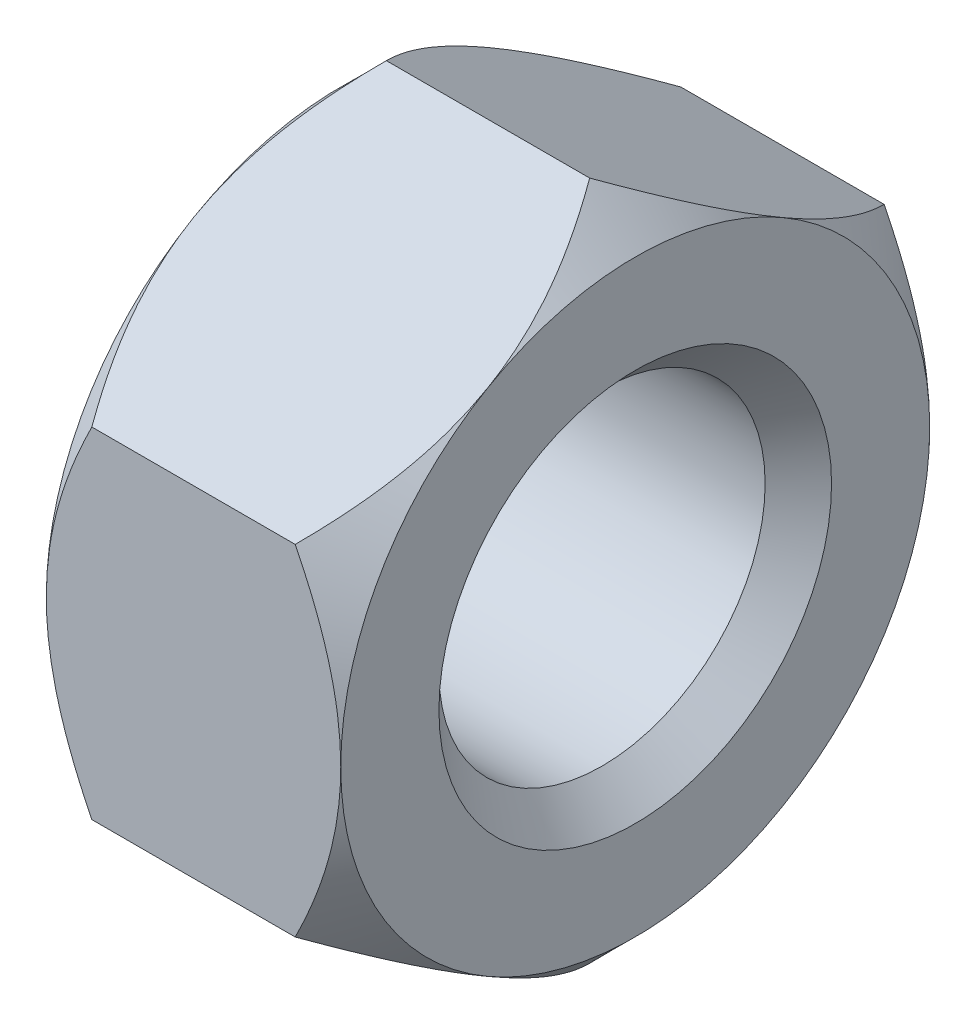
ISO-10303-21;
HEADER;
FILE_DESCRIPTION(('STEP AP214'),'2;1');
FILE_NAME('part.step','',(''),(''),'','','');
FILE_SCHEMA(('AUTOMOTIVE_DESIGN { 1 0 10303 214 1 1 1 1 }'));
ENDSEC;
DATA;
#1=APPLICATION_CONTEXT('core data for automotive mechanical design processes');
#2=APPLICATION_PROTOCOL_DEFINITION('international standard','automotive_design',2000,#1);
#3=PRODUCT_CONTEXT('',#1,'mechanical');
#4=PRODUCT('Part','Part','',(#3));
#5=PRODUCT_RELATED_PRODUCT_CATEGORY('part','',(#4));
#6=PRODUCT_DEFINITION_FORMATION('','',#4);
#7=PRODUCT_DEFINITION_CONTEXT('part definition',#1,'design');
#8=PRODUCT_DEFINITION('design','',#6,#7);
#9=PRODUCT_DEFINITION_SHAPE('','',#8);
#10=(LENGTH_UNIT() NAMED_UNIT(*) SI_UNIT(.MILLI.,.METRE.));
#11=(NAMED_UNIT(*) PLANE_ANGLE_UNIT() SI_UNIT($,.RADIAN.));
#12=(NAMED_UNIT(*) SI_UNIT($,.STERADIAN.) SOLID_ANGLE_UNIT());
#13=UNCERTAINTY_MEASURE_WITH_UNIT(LENGTH_MEASURE(1.E-05),#10,'distance_accuracy_value','');
#14=(GEOMETRIC_REPRESENTATION_CONTEXT(3) GLOBAL_UNCERTAINTY_ASSIGNED_CONTEXT((#13)) GLOBAL_UNIT_ASSIGNED_CONTEXT((#10,
#11,#12)) REPRESENTATION_CONTEXT('',''));
#15=CARTESIAN_POINT('',(0.,0.,0.));
#16=DIRECTION('',(0.,0.,1.));
#17=DIRECTION('',(1.,0.,0.));
#18=AXIS2_PLACEMENT_3D('',#15,#16,#17);
#19=CARTESIAN_POINT('',(1.2,0.,0.));
#20=DIRECTION('',(1.,0.,0.));
#21=DIRECTION('',(0.,0.,-1.));
#22=AXIS2_PLACEMENT_3D('',#19,#20,#21);
#23=CONICAL_SURFACE('',#22,7.2,0.785398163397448);
#24=CARTESIAN_POINT('',(0.928318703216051,-3.46398614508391,-6.0002));
#25=CARTESIAN_POINT('',(0.868761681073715,-3.52354912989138,-5.89703388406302));
#26=CARTESIAN_POINT('',(0.811032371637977,-3.58356994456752,-5.79307478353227));
#27=CARTESIAN_POINT('',(0.699785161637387,-3.70461705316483,-5.58341504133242));
#28=CARTESIAN_POINT('',(0.64626956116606,-3.76564387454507,-5.47771348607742));
#29=CARTESIAN_POINT('',(0.492420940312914,-3.95093502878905,-5.15677979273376));
#30=CARTESIAN_POINT('',(0.399442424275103,-4.07676794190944,-4.93883079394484));
#31=CARTESIAN_POINT('',(0.240223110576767,-4.33052007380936,-4.49931920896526));
#32=CARTESIAN_POINT('',(0.173581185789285,-4.45837443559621,-4.27786895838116));
#33=CARTESIAN_POINT('',(0.0964928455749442,-4.65225794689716,-3.94205286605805));
#34=CARTESIAN_POINT('',(0.0746194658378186,-4.71717123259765,-3.82961975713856));
#35=CARTESIAN_POINT('',(0.0389925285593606,-4.84754743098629,-3.60380155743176));
#36=CARTESIAN_POINT('',(0.0252377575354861,-4.9130102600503,-3.49041661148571));
#37=CARTESIAN_POINT('',(0.0021759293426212,-5.0725340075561,-3.21411337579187));
#38=CARTESIAN_POINT('',(-0.00266289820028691,-5.16676680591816,-3.05089738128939));
#39=CARTESIAN_POINT('',(0.0054586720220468,-5.35506256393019,-2.72475956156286));
#40=CARTESIAN_POINT('',(0.0184253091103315,-5.44912545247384,-2.56183785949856));
#41=CARTESIAN_POINT('',(0.0613934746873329,-5.63636442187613,-2.23753045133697));
#42=CARTESIAN_POINT('',(0.0914140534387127,-5.72953939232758,-2.07614666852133));
#43=CARTESIAN_POINT('',(0.166857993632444,-5.91428788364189,-1.75615289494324));
#44=CARTESIAN_POINT('',(0.212280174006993,-6.00586152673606,-1.59754269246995));
#45=CARTESIAN_POINT('',(0.305727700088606,-6.16842140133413,-1.31598073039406));
#46=CARTESIAN_POINT('',(0.351295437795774,-6.23976758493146,-1.19240551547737));
#47=CARTESIAN_POINT('',(0.449774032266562,-6.38117919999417,-0.947473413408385));
#48=CARTESIAN_POINT('',(0.502685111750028,-6.45124459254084,-0.826116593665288));
#49=CARTESIAN_POINT('',(0.614664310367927,-6.58987394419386,-0.586003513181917));
#50=CARTESIAN_POINT('',(0.673713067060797,-6.6584418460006,-0.467240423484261));
#51=CARTESIAN_POINT('',(0.797192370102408,-6.79430795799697,-0.231913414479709));
#52=CARTESIAN_POINT('',(0.861619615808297,-6.86160691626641,-0.115348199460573));
#53=CARTESIAN_POINT('',(0.92831870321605,-6.92831870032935,0.000199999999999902));
#54=B_SPLINE_CURVE_WITH_KNOTS('',3,(#24,#25,#26,#27,#28,#29,#30,#31,#32,#33,#34,#35,#36,#37,#38,
#39,#40,#41,#42,#43,#44,#45,#46,#47,#48,#49,#50,#51,#52,#53),.UNSPECIFIED.,.F.,.F.,(4,2,2,2,2,2,
2,2,2,2,2,2,2,2,4),(0.,0.399529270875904,0.799275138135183,1.6030826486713,2.39412640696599,
2.78887248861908,3.18355955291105,3.74826388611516,4.31316615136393,4.87870069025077,
5.44419187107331,5.89335590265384,6.34253356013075,6.79033489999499,7.23786342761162),.UNSPECIFIED.);
#55=CARTESIAN_POINT('',(0.,-5.19615242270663,-3.));
#56=VERTEX_POINT('',#55);
#57=CARTESIAN_POINT('',(0.928203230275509,-6.92820323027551,0.));
#58=VERTEX_POINT('',#57);
#59=EDGE_CURVE('E306',#56,#58,#54,.T.);
#60=ORIENTED_EDGE('',*,*,#59,.T.);
#61=CARTESIAN_POINT('',(0.928318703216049,-6.92831870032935,-0.000200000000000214));
#62=CARTESIAN_POINT('',(0.868761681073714,-6.86875571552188,0.102966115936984));
#63=CARTESIAN_POINT('',(0.811032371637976,-6.80873490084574,0.206925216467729));
#64=CARTESIAN_POINT('',(0.699785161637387,-6.68768779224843,0.416584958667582));
#65=CARTESIAN_POINT('',(0.64626956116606,-6.62666097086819,0.52228651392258));
#66=CARTESIAN_POINT('',(0.492420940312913,-6.44136981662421,0.843220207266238));
#67=CARTESIAN_POINT('',(0.399442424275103,-6.31553690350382,1.06116920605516));
#68=CARTESIAN_POINT('',(0.240223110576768,-6.0617847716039,1.50068079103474));
#69=CARTESIAN_POINT('',(0.173581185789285,-5.93393040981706,1.72213104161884));
#70=CARTESIAN_POINT('',(0.0964928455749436,-5.74004689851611,2.05794713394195));
#71=CARTESIAN_POINT('',(0.074619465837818,-5.67513361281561,2.17038024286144));
#72=CARTESIAN_POINT('',(0.03899252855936,-5.54475741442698,2.39619844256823));
#73=CARTESIAN_POINT('',(0.0252377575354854,-5.47929458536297,2.50958338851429));
#74=CARTESIAN_POINT('',(0.00217592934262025,-5.31977083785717,2.78588662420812));
#75=CARTESIAN_POINT('',(-0.00266289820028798,-5.22553803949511,2.9491026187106));
#76=CARTESIAN_POINT('',(0.00545867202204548,-5.03724228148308,3.27524043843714));
#77=CARTESIAN_POINT('',(0.0184253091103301,-4.94317939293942,3.43816214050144));
#78=CARTESIAN_POINT('',(0.0613934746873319,-4.75594042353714,3.76246954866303));
#79=CARTESIAN_POINT('',(0.0914140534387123,-4.66276545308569,3.92385333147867));
#80=CARTESIAN_POINT('',(0.166857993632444,-4.47801696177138,4.24384710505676));
#81=CARTESIAN_POINT('',(0.212280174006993,-4.3864433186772,4.40245730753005));
#82=CARTESIAN_POINT('',(0.305727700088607,-4.22388344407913,4.68401926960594));
#83=CARTESIAN_POINT('',(0.351295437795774,-4.15253726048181,4.80759448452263));
#84=CARTESIAN_POINT('',(0.449774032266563,-4.0111256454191,5.05252658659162));
#85=CARTESIAN_POINT('',(0.502685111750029,-3.94106025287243,5.17388340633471));
#86=CARTESIAN_POINT('',(0.614664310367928,-3.8024309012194,5.41399648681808));
#87=CARTESIAN_POINT('',(0.673713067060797,-3.73386299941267,5.53275957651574));
#88=CARTESIAN_POINT('',(0.797192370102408,-3.5979968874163,5.76808658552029));
#89=CARTESIAN_POINT('',(0.861619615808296,-3.53069792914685,5.88465180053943));
#90=CARTESIAN_POINT('',(0.92831870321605,-3.46398614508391,6.0002));
#91=B_SPLINE_CURVE_WITH_KNOTS('',3,(#61,#62,#63,#64,#65,#66,#67,#68,#69,#70,#71,#72,#73,#74,#75,
#76,#77,#78,#79,#80,#81,#82,#83,#84,#85,#86,#87,#88,#89,#90),.UNSPECIFIED.,.F.,.F.,(4,2,2,2,2,2,
2,2,2,2,2,2,2,2,4),(0.,0.399529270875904,0.799275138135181,1.6030826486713,2.39412640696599,
2.78887248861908,3.18355955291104,3.74826388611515,4.31316615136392,4.87870069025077,
5.44419187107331,5.89335590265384,6.34253356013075,6.79033489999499,7.23786342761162),.UNSPECIFIED.);
#92=CARTESIAN_POINT('',(0.,-5.19615242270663,3.));
#93=VERTEX_POINT('',#92);
#94=EDGE_CURVE('E234',#58,#93,#91,.T.);
#95=ORIENTED_EDGE('',*,*,#94,.T.);
#96=CARTESIAN_POINT('',(0.,0.,0.));
#97=DIRECTION('',(-1.,0.,0.));
#98=DIRECTION('',(0.,0.,1.));
#99=AXIS2_PLACEMENT_3D('',#96,#97,#98);
#100=CIRCLE('',#99,6.);
#101=EDGE_CURVE('E270',#56,#93,#100,.T.);
#102=ORIENTED_EDGE('',*,*,#101,.F.);
#103=EDGE_LOOP('',(#60,#95,#102));
#104=FACE_BOUND('',#103,.T.);
#105=ADVANCED_FACE('F16',(#104),#23,.T.);
#106=CARTESIAN_POINT('',(0.,0.,6.));
#107=VERTEX_POINT('',#106);
#108=EDGE_CURVE('E25',#93,#107,#100,.T.);
#109=ORIENTED_EDGE('',*,*,#108,.F.);
#110=CARTESIAN_POINT('',(0.928203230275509,-3.46410161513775,6.));
#111=VERTEX_POINT('',#110);
#112=EDGE_CURVE('E235',#93,#111,#91,.T.);
#113=ORIENTED_EDGE('',*,*,#112,.T.);
#114=CARTESIAN_POINT('',(3.47987604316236,-7.33948566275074,6.));
#115=CARTESIAN_POINT('',(3.34294599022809,-7.16258361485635,6.));
#116=CARTESIAN_POINT('',(3.2072121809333,-6.98474101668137,6.));
#117=CARTESIAN_POINT('',(2.93868717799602,-6.62678585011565,6.));
#118=CARTESIAN_POINT('',(2.80589667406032,-6.446672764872,6.));
#119=CARTESIAN_POINT('',(2.54286396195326,-6.0824730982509,6.));
#120=CARTESIAN_POINT('',(2.41264923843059,-5.89836660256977,6.));
#121=CARTESIAN_POINT('',(2.15664623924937,-5.52711162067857,6.));
#122=CARTESIAN_POINT('',(2.03085766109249,-5.33996334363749,6.));
#123=CARTESIAN_POINT('',(1.77665145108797,-4.94971277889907,6.));
#124=CARTESIAN_POINT('',(1.64860246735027,-4.7463691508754,6.));
#125=CARTESIAN_POINT('',(1.40029956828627,-4.33490017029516,6.));
#126=CARTESIAN_POINT('',(1.28004699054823,-4.12677400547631,6.));
#127=CARTESIAN_POINT('',(1.04988607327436,-3.70565740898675,6.));
#128=CARTESIAN_POINT('',(0.939947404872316,-3.49268368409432,6.));
#129=CARTESIAN_POINT('',(0.732877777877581,-3.06064741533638,6.));
#130=CARTESIAN_POINT('',(0.635740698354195,-2.84158784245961,6.));
#131=CARTESIAN_POINT('',(0.467107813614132,-2.42007531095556,6.));
#132=CARTESIAN_POINT('',(0.393993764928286,-2.2182763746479,6.));
#133=CARTESIAN_POINT('',(0.263909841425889,-1.8094430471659,6.));
#134=CARTESIAN_POINT('',(0.206940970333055,-1.6024083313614,6.));
#135=CARTESIAN_POINT('',(0.113220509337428,-1.18800324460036,6.));
#136=CARTESIAN_POINT('',(0.0760944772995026,-0.980719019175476,6.));
#137=CARTESIAN_POINT('',(0.0228506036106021,-0.563454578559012,6.));
#138=CARTESIAN_POINT('',(0.00672812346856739,-0.353474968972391,6.));
#139=CARTESIAN_POINT('',(-0.00307623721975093,0.0572444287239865,6.));
#140=CARTESIAN_POINT('',(0.00223419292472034,0.257960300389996,6.));
#141=CARTESIAN_POINT('',(0.0326631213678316,0.657874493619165,6.));
#142=CARTESIAN_POINT('',(0.0577833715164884,0.857072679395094,6.));
#143=CARTESIAN_POINT('',(0.126821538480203,1.25588993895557,6.));
#144=CARTESIAN_POINT('',(0.171075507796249,1.45544982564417,6.));
#145=CARTESIAN_POINT('',(0.275893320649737,1.85015647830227,6.));
#146=CARTESIAN_POINT('',(0.336456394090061,2.04530345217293,6.));
#147=CARTESIAN_POINT('',(0.474332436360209,2.43982581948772,6.));
#148=CARTESIAN_POINT('',(0.552297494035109,2.63897061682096,6.));
#149=CARTESIAN_POINT('',(0.720291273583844,3.03215031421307,6.));
#150=CARTESIAN_POINT('',(0.810325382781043,3.22618288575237,6.));
#151=CARTESIAN_POINT('',(1.00032353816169,3.61004589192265,6.));
#152=CARTESIAN_POINT('',(1.10031798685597,3.79986115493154,6.));
#153=CARTESIAN_POINT('',(1.30803908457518,4.17514690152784,6.));
#154=CARTESIAN_POINT('',(1.41576455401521,4.36061804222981,6.));
#155=CARTESIAN_POINT('',(1.63197601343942,4.71872935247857,6.));
#156=CARTESIAN_POINT('',(1.7401625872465,4.89155125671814,6.));
#157=CARTESIAN_POINT('',(1.96115434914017,5.23422543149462,6.));
#158=CARTESIAN_POINT('',(2.07395988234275,5.40407747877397,6.));
#159=CARTESIAN_POINT('',(2.30245181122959,5.73983837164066,6.));
#160=CARTESIAN_POINT('',(2.41810793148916,5.90576789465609,6.));
#161=CARTESIAN_POINT('',(2.65253085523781,6.23534855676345,6.));
#162=CARTESIAN_POINT('',(2.77129679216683,6.39900031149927,6.));
#163=CARTESIAN_POINT('',(2.8913360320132,6.56169615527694,6.));
#164=B_SPLINE_CURVE_WITH_KNOTS('',3,(#114,#115,#116,#117,#118,#119,#120,#121,#122,#123,#124,
#125,#126,#127,#128,#129,#130,#131,#132,#133,#134,#135,#136,#137,#138,#139,#140,#141,#142,#143,
#144,#145,#146,#147,#148,#149,#150,#151,#152,#153,#154,#155,#156,#157,#158,#159,#160,#161,#162,
#163),.UNSPECIFIED.,.F.,.F.,(4,2,2,2,2,2,2,2,2,2,2,2,2,2,2,2,2,2,2,2,2,2,2,2,4),(0.,
0.67112865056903,1.34241293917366,2.01886460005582,2.69526993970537,3.41603774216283,
4.1369288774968,4.8556289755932,5.57398417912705,6.21733955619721,6.86073492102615,
7.49151728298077,8.1221603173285,8.7235066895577,9.32490624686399,9.9373271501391,
10.5497191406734,11.190817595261,11.8322031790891,12.475610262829,13.1189193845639,
13.7305078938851,14.3421421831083,14.9488822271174,15.555454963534),.UNSPECIFIED.);
#165=EDGE_CURVE('E244',#111,#107,#164,.T.);
#166=ORIENTED_EDGE('',*,*,#165,.T.);
#167=EDGE_LOOP('',(#109,#113,#166));
#168=FACE_BOUND('',#167,.T.);
#169=ADVANCED_FACE('F296',(#168),#23,.T.);
#170=CARTESIAN_POINT('',(0.,5.19615242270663,3.));
#171=VERTEX_POINT('',#170);
#172=EDGE_CURVE('E11',#107,#171,#100,.T.);
#173=ORIENTED_EDGE('',*,*,#172,.F.);
#174=CARTESIAN_POINT('',(0.928203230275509,3.46410161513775,6.));
#175=VERTEX_POINT('',#174);
#176=EDGE_CURVE('E135',#107,#175,#164,.T.);
#177=ORIENTED_EDGE('',*,*,#176,.T.);
#178=CARTESIAN_POINT('',(0.928318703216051,3.46398614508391,6.0002));
#179=CARTESIAN_POINT('',(0.868761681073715,3.52354912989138,5.89703388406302));
#180=CARTESIAN_POINT('',(0.811032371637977,3.58356994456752,5.79307478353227));
#181=CARTESIAN_POINT('',(0.699785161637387,3.70461705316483,5.58341504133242));
#182=CARTESIAN_POINT('',(0.64626956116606,3.76564387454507,5.47771348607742));
#183=CARTESIAN_POINT('',(0.492420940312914,3.95093502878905,5.15677979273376));
#184=CARTESIAN_POINT('',(0.399442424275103,4.07676794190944,4.93883079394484));
#185=CARTESIAN_POINT('',(0.240223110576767,4.33052007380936,4.49931920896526));
#186=CARTESIAN_POINT('',(0.173581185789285,4.45837443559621,4.27786895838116));
#187=CARTESIAN_POINT('',(0.0964928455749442,4.65225794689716,3.94205286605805));
#188=CARTESIAN_POINT('',(0.0746194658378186,4.71717123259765,3.82961975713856));
#189=CARTESIAN_POINT('',(0.0389925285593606,4.84754743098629,3.60380155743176));
#190=CARTESIAN_POINT('',(0.0252377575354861,4.9130102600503,3.49041661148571));
#191=CARTESIAN_POINT('',(0.0021759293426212,5.0725340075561,3.21411337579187));
#192=CARTESIAN_POINT('',(-0.00266289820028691,5.16676680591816,3.05089738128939));
#193=CARTESIAN_POINT('',(0.0054586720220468,5.35506256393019,2.72475956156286));
#194=CARTESIAN_POINT('',(0.0184253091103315,5.44912545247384,2.56183785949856));
#195=CARTESIAN_POINT('',(0.0613934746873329,5.63636442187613,2.23753045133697));
#196=CARTESIAN_POINT('',(0.0914140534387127,5.72953939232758,2.07614666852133));
#197=CARTESIAN_POINT('',(0.166857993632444,5.91428788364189,1.75615289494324));
#198=CARTESIAN_POINT('',(0.212280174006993,6.00586152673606,1.59754269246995));
#199=CARTESIAN_POINT('',(0.305727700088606,6.16842140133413,1.31598073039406));
#200=CARTESIAN_POINT('',(0.351295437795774,6.23976758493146,1.19240551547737));
#201=CARTESIAN_POINT('',(0.449774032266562,6.38117919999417,0.947473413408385));
#202=CARTESIAN_POINT('',(0.502685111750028,6.45124459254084,0.826116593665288));
#203=CARTESIAN_POINT('',(0.614664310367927,6.58987394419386,0.586003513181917));
#204=CARTESIAN_POINT('',(0.673713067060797,6.6584418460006,0.467240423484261));
#205=CARTESIAN_POINT('',(0.797192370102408,6.79430795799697,0.231913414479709));
#206=CARTESIAN_POINT('',(0.861619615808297,6.86160691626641,0.115348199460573));
#207=CARTESIAN_POINT('',(0.92831870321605,6.92831870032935,-0.000199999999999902));
#208=B_SPLINE_CURVE_WITH_KNOTS('',3,(#178,#179,#180,#181,#182,#183,#184,#185,#186,#187,#188,
#189,#190,#191,#192,#193,#194,#195,#196,#197,#198,#199,#200,#201,#202,#203,#204,#205,#206,#207),
.UNSPECIFIED.,.F.,.F.,(4,2,2,2,2,2,2,2,2,2,2,2,2,2,4),(0.,0.399529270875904,0.799275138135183,
1.6030826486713,2.39412640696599,2.78887248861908,3.18355955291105,3.74826388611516,
4.31316615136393,4.87870069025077,5.44419187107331,5.89335590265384,6.34253356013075,
6.79033489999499,7.23786342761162),.UNSPECIFIED.);
#209=EDGE_CURVE('E136',#175,#171,#208,.T.);
#210=ORIENTED_EDGE('',*,*,#209,.T.);
#211=EDGE_LOOP('',(#173,#177,#210));
#212=FACE_BOUND('',#211,.T.);
#213=ADVANCED_FACE('F134',(#212),#23,.T.);
#214=CARTESIAN_POINT('',(3.47987604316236,-7.33948566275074,-6.));
#215=CARTESIAN_POINT('',(3.34294599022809,-7.16258361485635,-6.));
#216=CARTESIAN_POINT('',(3.2072121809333,-6.98474101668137,-6.));
#217=CARTESIAN_POINT('',(2.93868717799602,-6.62678585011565,-6.));
#218=CARTESIAN_POINT('',(2.80589667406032,-6.446672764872,-6.));
#219=CARTESIAN_POINT('',(2.54286396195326,-6.0824730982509,-6.));
#220=CARTESIAN_POINT('',(2.41264923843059,-5.89836660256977,-6.));
#221=CARTESIAN_POINT('',(2.15664623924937,-5.52711162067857,-6.));
#222=CARTESIAN_POINT('',(2.03085766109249,-5.33996334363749,-6.));
#223=CARTESIAN_POINT('',(1.77665145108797,-4.94971277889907,-6.));
#224=CARTESIAN_POINT('',(1.64860246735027,-4.7463691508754,-6.));
#225=CARTESIAN_POINT('',(1.40029956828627,-4.33490017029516,-6.));
#226=CARTESIAN_POINT('',(1.28004699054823,-4.12677400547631,-6.));
#227=CARTESIAN_POINT('',(1.04988607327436,-3.70565740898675,-6.));
#228=CARTESIAN_POINT('',(0.939947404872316,-3.49268368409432,-6.));
#229=CARTESIAN_POINT('',(0.732877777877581,-3.06064741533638,-6.));
#230=CARTESIAN_POINT('',(0.635740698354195,-2.84158784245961,-6.));
#231=CARTESIAN_POINT('',(0.467107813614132,-2.42007531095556,-6.));
#232=CARTESIAN_POINT('',(0.393993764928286,-2.2182763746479,-6.));
#233=CARTESIAN_POINT('',(0.263909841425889,-1.8094430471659,-6.));
#234=CARTESIAN_POINT('',(0.206940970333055,-1.6024083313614,-6.));
#235=CARTESIAN_POINT('',(0.113220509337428,-1.18800324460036,-6.));
#236=CARTESIAN_POINT('',(0.0760944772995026,-0.980719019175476,-6.));
#237=CARTESIAN_POINT('',(0.0228506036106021,-0.563454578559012,-6.));
#238=CARTESIAN_POINT('',(0.00672812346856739,-0.353474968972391,-6.));
#239=CARTESIAN_POINT('',(-0.00307623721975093,0.0572444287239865,-6.));
#240=CARTESIAN_POINT('',(0.00223419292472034,0.257960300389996,-6.));
#241=CARTESIAN_POINT('',(0.0326631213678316,0.657874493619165,-6.));
#242=CARTESIAN_POINT('',(0.0577833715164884,0.857072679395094,-6.));
#243=CARTESIAN_POINT('',(0.126821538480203,1.25588993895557,-6.));
#244=CARTESIAN_POINT('',(0.171075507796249,1.45544982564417,-6.));
#245=CARTESIAN_POINT('',(0.275893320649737,1.85015647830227,-6.));
#246=CARTESIAN_POINT('',(0.336456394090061,2.04530345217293,-6.));
#247=CARTESIAN_POINT('',(0.474332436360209,2.43982581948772,-6.));
#248=CARTESIAN_POINT('',(0.552297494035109,2.63897061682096,-6.));
#249=CARTESIAN_POINT('',(0.720291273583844,3.03215031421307,-6.));
#250=CARTESIAN_POINT('',(0.810325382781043,3.22618288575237,-6.));
#251=CARTESIAN_POINT('',(1.00032353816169,3.61004589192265,-6.));
#252=CARTESIAN_POINT('',(1.10031798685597,3.79986115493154,-6.));
#253=CARTESIAN_POINT('',(1.30803908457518,4.17514690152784,-6.));
#254=CARTESIAN_POINT('',(1.41576455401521,4.36061804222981,-6.));
#255=CARTESIAN_POINT('',(1.63197601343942,4.71872935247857,-6.));
#256=CARTESIAN_POINT('',(1.7401625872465,4.89155125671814,-6.));
#257=CARTESIAN_POINT('',(1.96115434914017,5.23422543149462,-6.));
#258=CARTESIAN_POINT('',(2.07395988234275,5.40407747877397,-6.));
#259=CARTESIAN_POINT('',(2.30245181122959,5.73983837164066,-6.));
#260=CARTESIAN_POINT('',(2.41810793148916,5.90576789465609,-6.));
#261=CARTESIAN_POINT('',(2.65253085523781,6.23534855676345,-6.));
#262=CARTESIAN_POINT('',(2.77129679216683,6.39900031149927,-6.));
#263=CARTESIAN_POINT('',(2.8913360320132,6.56169615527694,-6.));
#264=B_SPLINE_CURVE_WITH_KNOTS('',3,(#214,#215,#216,#217,#218,#219,#220,#221,#222,#223,#224,
#225,#226,#227,#228,#229,#230,#231,#232,#233,#234,#235,#236,#237,#238,#239,#240,#241,#242,#243,
#244,#245,#246,#247,#248,#249,#250,#251,#252,#253,#254,#255,#256,#257,#258,#259,#260,#261,#262,
#263),.UNSPECIFIED.,.F.,.F.,(4,2,2,2,2,2,2,2,2,2,2,2,2,2,2,2,2,2,2,2,2,2,2,2,4),(0.,
0.67112865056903,1.34241293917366,2.01886460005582,2.69526993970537,3.41603774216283,
4.1369288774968,4.8556289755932,5.57398417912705,6.21733955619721,6.86073492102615,
7.49151728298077,8.1221603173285,8.7235066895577,9.32490624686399,9.9373271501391,
10.5497191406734,11.190817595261,11.8322031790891,12.475610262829,13.1189193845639,
13.7305078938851,14.3421421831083,14.9488822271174,15.555454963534),.UNSPECIFIED.);
#265=CARTESIAN_POINT('',(0.,0.,-6.));
#266=VERTEX_POINT('',#265);
#267=CARTESIAN_POINT('',(0.928203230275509,-3.46410161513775,-6.));
#268=VERTEX_POINT('',#267);
#269=EDGE_CURVE('E362',#266,#268,#264,.F.);
#270=ORIENTED_EDGE('',*,*,#269,.T.);
#271=EDGE_CURVE('E310',#268,#56,#54,.T.);
#272=ORIENTED_EDGE('',*,*,#271,.T.);
#273=EDGE_CURVE('E126',#266,#56,#100,.T.);
#274=ORIENTED_EDGE('',*,*,#273,.F.);
#275=EDGE_LOOP('',(#270,#272,#274));
#276=FACE_BOUND('',#275,.T.);
#277=ADVANCED_FACE('F369',(#276),#23,.T.);
#278=CARTESIAN_POINT('',(0.,5.19615242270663,-3.));
#279=VERTEX_POINT('',#278);
#280=EDGE_CURVE('E24',#171,#279,#100,.T.);
#281=ORIENTED_EDGE('',*,*,#280,.F.);
#282=CARTESIAN_POINT('',(0.928203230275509,6.92820323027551,0.));
#283=VERTEX_POINT('',#282);
#284=EDGE_CURVE('E117',#171,#283,#208,.T.);
#285=ORIENTED_EDGE('',*,*,#284,.T.);
#286=CARTESIAN_POINT('',(0.928318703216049,6.92831870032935,0.000200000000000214));
#287=CARTESIAN_POINT('',(0.868761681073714,6.86875571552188,-0.102966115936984));
#288=CARTESIAN_POINT('',(0.811032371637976,6.80873490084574,-0.206925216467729));
#289=CARTESIAN_POINT('',(0.699785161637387,6.68768779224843,-0.416584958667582));
#290=CARTESIAN_POINT('',(0.64626956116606,6.62666097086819,-0.52228651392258));
#291=CARTESIAN_POINT('',(0.492420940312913,6.44136981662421,-0.843220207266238));
#292=CARTESIAN_POINT('',(0.399442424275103,6.31553690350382,-1.06116920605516));
#293=CARTESIAN_POINT('',(0.240223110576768,6.0617847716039,-1.50068079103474));
#294=CARTESIAN_POINT('',(0.173581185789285,5.93393040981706,-1.72213104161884));
#295=CARTESIAN_POINT('',(0.0964928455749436,5.74004689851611,-2.05794713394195));
#296=CARTESIAN_POINT('',(0.074619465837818,5.67513361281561,-2.17038024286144));
#297=CARTESIAN_POINT('',(0.03899252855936,5.54475741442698,-2.39619844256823));
#298=CARTESIAN_POINT('',(0.0252377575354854,5.47929458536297,-2.50958338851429));
#299=CARTESIAN_POINT('',(0.00217592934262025,5.31977083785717,-2.78588662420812));
#300=CARTESIAN_POINT('',(-0.00266289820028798,5.22553803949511,-2.9491026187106));
#301=CARTESIAN_POINT('',(0.00545867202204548,5.03724228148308,-3.27524043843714));
#302=CARTESIAN_POINT('',(0.0184253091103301,4.94317939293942,-3.43816214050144));
#303=CARTESIAN_POINT('',(0.0613934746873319,4.75594042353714,-3.76246954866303));
#304=CARTESIAN_POINT('',(0.0914140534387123,4.66276545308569,-3.92385333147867));
#305=CARTESIAN_POINT('',(0.166857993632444,4.47801696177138,-4.24384710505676));
#306=CARTESIAN_POINT('',(0.212280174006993,4.3864433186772,-4.40245730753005));
#307=CARTESIAN_POINT('',(0.305727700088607,4.22388344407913,-4.68401926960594));
#308=CARTESIAN_POINT('',(0.351295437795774,4.15253726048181,-4.80759448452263));
#309=CARTESIAN_POINT('',(0.449774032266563,4.0111256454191,-5.05252658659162));
#310=CARTESIAN_POINT('',(0.502685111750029,3.94106025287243,-5.17388340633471));
#311=CARTESIAN_POINT('',(0.614664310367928,3.8024309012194,-5.41399648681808));
#312=CARTESIAN_POINT('',(0.673713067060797,3.73386299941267,-5.53275957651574));
#313=CARTESIAN_POINT('',(0.797192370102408,3.5979968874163,-5.76808658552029));
#314=CARTESIAN_POINT('',(0.861619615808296,3.53069792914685,-5.88465180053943));
#315=CARTESIAN_POINT('',(0.92831870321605,3.46398614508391,-6.0002));
#316=B_SPLINE_CURVE_WITH_KNOTS('',3,(#286,#287,#288,#289,#290,#291,#292,#293,#294,#295,#296,
#297,#298,#299,#300,#301,#302,#303,#304,#305,#306,#307,#308,#309,#310,#311,#312,#313,#314,#315),
.UNSPECIFIED.,.F.,.F.,(4,2,2,2,2,2,2,2,2,2,2,2,2,2,4),(0.,0.399529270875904,0.799275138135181,
1.6030826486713,2.39412640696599,2.78887248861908,3.18355955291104,3.74826388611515,
4.31316615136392,4.87870069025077,5.44419187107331,5.89335590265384,6.34253356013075,
6.79033489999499,7.23786342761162),.UNSPECIFIED.);
#317=EDGE_CURVE('E106',#283,#279,#316,.T.);
#318=ORIENTED_EDGE('',*,*,#317,.T.);
#319=EDGE_LOOP('',(#281,#285,#318));
#320=FACE_BOUND('',#319,.T.);
#321=ADVANCED_FACE('F115',(#320),#23,.T.);
#322=CARTESIAN_POINT('',(6.,0.,0.));
#323=DIRECTION('',(-1.,0.,0.));
#324=DIRECTION('',(0.,0.,1.));
#325=AXIS2_PLACEMENT_3D('',#322,#323,#324);
#326=CONICAL_SURFACE('',#325,6.,0.785398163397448);
#327=CARTESIAN_POINT('',(5.07168129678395,3.46398614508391,-6.0002));
#328=CARTESIAN_POINT('',(5.13123831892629,3.52354912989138,-5.89703388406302));
#329=CARTESIAN_POINT('',(5.18896762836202,3.58356994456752,-5.79307478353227));
#330=CARTESIAN_POINT('',(5.30021483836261,3.70461705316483,-5.58341504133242));
#331=CARTESIAN_POINT('',(5.35373043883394,3.76564387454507,-5.47771348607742));
#332=CARTESIAN_POINT('',(5.50757905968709,3.95093502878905,-5.15677979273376));
#333=CARTESIAN_POINT('',(5.6005575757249,4.07676794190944,-4.93883079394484));
#334=CARTESIAN_POINT('',(5.75977688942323,4.33052007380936,-4.49931920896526));
#335=CARTESIAN_POINT('',(5.82641881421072,4.4583744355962,-4.27786895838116));
#336=CARTESIAN_POINT('',(5.90350715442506,4.65225794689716,-3.94205286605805));
#337=CARTESIAN_POINT('',(5.92538053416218,4.71717123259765,-3.82961975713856));
#338=CARTESIAN_POINT('',(5.96100747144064,4.84754743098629,-3.60380155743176));
#339=CARTESIAN_POINT('',(5.97476224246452,4.9130102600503,-3.49041661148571));
#340=CARTESIAN_POINT('',(5.99782407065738,5.0725340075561,-3.21411337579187));
#341=CARTESIAN_POINT('',(6.00266289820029,5.16676680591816,-3.05089738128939));
#342=CARTESIAN_POINT('',(5.99454132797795,5.35506256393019,-2.72475956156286));
#343=CARTESIAN_POINT('',(5.98157469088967,5.44912545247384,-2.56183785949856));
#344=CARTESIAN_POINT('',(5.93860652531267,5.63636442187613,-2.23753045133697));
#345=CARTESIAN_POINT('',(5.90858594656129,5.72953939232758,-2.07614666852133));
#346=CARTESIAN_POINT('',(5.83314200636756,5.91428788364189,-1.75615289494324));
#347=CARTESIAN_POINT('',(5.78771982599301,6.00586152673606,-1.59754269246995));
#348=CARTESIAN_POINT('',(5.6942722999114,6.16842140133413,-1.31598073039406));
#349=CARTESIAN_POINT('',(5.64870456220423,6.23976758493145,-1.19240551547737));
#350=CARTESIAN_POINT('',(5.55022596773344,6.38117919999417,-0.947473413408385));
#351=CARTESIAN_POINT('',(5.49731488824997,6.45124459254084,-0.826116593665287));
#352=CARTESIAN_POINT('',(5.38533568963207,6.58987394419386,-0.586003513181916));
#353=CARTESIAN_POINT('',(5.3262869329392,6.6584418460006,-0.467240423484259));
#354=CARTESIAN_POINT('',(5.20280762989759,6.79430795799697,-0.231913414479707));
#355=CARTESIAN_POINT('',(5.1383803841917,6.86160691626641,-0.115348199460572));
#356=CARTESIAN_POINT('',(5.07168129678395,6.92831870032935,0.000199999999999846));
#357=B_SPLINE_CURVE_WITH_KNOTS('',3,(#327,#328,#329,#330,#331,#332,#333,#334,#335,#336,#337,
#338,#339,#340,#341,#342,#343,#344,#345,#346,#347,#348,#349,#350,#351,#352,#353,#354,#355,#356),
.UNSPECIFIED.,.F.,.F.,(4,2,2,2,2,2,2,2,2,2,2,2,2,2,4),(0.,0.399529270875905,0.799275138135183,
1.6030826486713,2.39412640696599,2.78887248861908,3.18355955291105,3.74826388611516,
4.31316615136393,4.87870069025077,5.44419187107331,5.89335590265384,6.34253356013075,
6.79033489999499,7.23786342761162),.UNSPECIFIED.);
#358=CARTESIAN_POINT('',(6.,5.19615242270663,-3.));
#359=VERTEX_POINT('',#358);
#360=CARTESIAN_POINT('',(5.07179676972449,6.92820323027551,0.));
#361=VERTEX_POINT('',#360);
#362=EDGE_CURVE('E194',#359,#361,#357,.T.);
#363=ORIENTED_EDGE('',*,*,#362,.T.);
#364=CARTESIAN_POINT('',(5.07168129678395,6.92831870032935,-0.000200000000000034));
#365=CARTESIAN_POINT('',(5.13123831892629,6.86875571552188,0.102966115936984));
#366=CARTESIAN_POINT('',(5.18896762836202,6.80873490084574,0.20692521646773));
#367=CARTESIAN_POINT('',(5.30021483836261,6.68768779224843,0.416584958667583));
#368=CARTESIAN_POINT('',(5.35373043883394,6.6266609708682,0.522286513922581));
#369=CARTESIAN_POINT('',(5.50757905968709,6.44136981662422,0.843220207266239));
#370=CARTESIAN_POINT('',(5.6005575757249,6.31553690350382,1.06116920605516));
#371=CARTESIAN_POINT('',(5.75977688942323,6.0617847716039,1.50068079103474));
#372=CARTESIAN_POINT('',(5.82641881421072,5.93393040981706,1.72213104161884));
#373=CARTESIAN_POINT('',(5.90350715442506,5.74004689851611,2.05794713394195));
#374=CARTESIAN_POINT('',(5.92538053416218,5.67513361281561,2.17038024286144));
#375=CARTESIAN_POINT('',(5.96100747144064,5.54475741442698,2.39619844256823));
#376=CARTESIAN_POINT('',(5.97476224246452,5.47929458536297,2.50958338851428));
#377=CARTESIAN_POINT('',(5.99782407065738,5.31977083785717,2.78588662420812));
#378=CARTESIAN_POINT('',(6.00266289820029,5.22553803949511,2.9491026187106));
#379=CARTESIAN_POINT('',(5.99454132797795,5.03724228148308,3.27524043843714));
#380=CARTESIAN_POINT('',(5.98157469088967,4.94317939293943,3.43816214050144));
#381=CARTESIAN_POINT('',(5.93860652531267,4.75594042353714,3.76246954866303));
#382=CARTESIAN_POINT('',(5.90858594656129,4.66276545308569,3.92385333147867));
#383=CARTESIAN_POINT('',(5.83314200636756,4.47801696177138,4.24384710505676));
#384=CARTESIAN_POINT('',(5.78771982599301,4.3864433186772,4.40245730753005));
#385=CARTESIAN_POINT('',(5.6942722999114,4.22388344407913,4.68401926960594));
#386=CARTESIAN_POINT('',(5.64870456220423,4.15253726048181,4.80759448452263));
#387=CARTESIAN_POINT('',(5.55022596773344,4.0111256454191,5.05252658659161));
#388=CARTESIAN_POINT('',(5.49731488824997,3.94106025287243,5.17388340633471));
#389=CARTESIAN_POINT('',(5.38533568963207,3.8024309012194,5.41399648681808));
#390=CARTESIAN_POINT('',(5.3262869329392,3.73386299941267,5.53275957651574));
#391=CARTESIAN_POINT('',(5.20280762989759,3.5979968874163,5.76808658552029));
#392=CARTESIAN_POINT('',(5.1383803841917,3.53069792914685,5.88465180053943));
#393=CARTESIAN_POINT('',(5.07168129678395,3.46398614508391,6.0002));
#394=B_SPLINE_CURVE_WITH_KNOTS('',3,(#364,#365,#366,#367,#368,#369,#370,#371,#372,#373,#374,
#375,#376,#377,#378,#379,#380,#381,#382,#383,#384,#385,#386,#387,#388,#389,#390,#391,#392,#393),
.UNSPECIFIED.,.F.,.F.,(4,2,2,2,2,2,2,2,2,2,2,2,2,2,4),(0.,0.399529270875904,0.799275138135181,
1.6030826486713,2.39412640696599,2.78887248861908,3.18355955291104,3.74826388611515,
4.31316615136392,4.87870069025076,5.4441918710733,5.89335590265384,6.34253356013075,
6.79033489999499,7.23786342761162),.UNSPECIFIED.);
#395=CARTESIAN_POINT('',(6.,5.19615242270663,3.));
#396=VERTEX_POINT('',#395);
#397=EDGE_CURVE('E145',#361,#396,#394,.T.);
#398=ORIENTED_EDGE('',*,*,#397,.T.);
#399=CARTESIAN_POINT('',(6.,0.,0.));
#400=DIRECTION('',(-1.,0.,0.));
#401=DIRECTION('',(0.,0.,1.));
#402=AXIS2_PLACEMENT_3D('',#399,#400,#401);
#403=CIRCLE('',#402,6.);
#404=EDGE_CURVE('E269',#396,#359,#403,.T.);
#405=ORIENTED_EDGE('',*,*,#404,.T.);
#406=EDGE_LOOP('',(#363,#398,#405));
#407=FACE_BOUND('',#406,.T.);
#408=ADVANCED_FACE('F189',(#407),#326,.T.);
#409=CARTESIAN_POINT('',(6.,0.,6.));
#410=VERTEX_POINT('',#409);
#411=EDGE_CURVE('E253',#410,#396,#403,.T.);
#412=ORIENTED_EDGE('',*,*,#411,.T.);
#413=CARTESIAN_POINT('',(5.07179676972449,3.46410161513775,6.));
#414=VERTEX_POINT('',#413);
#415=EDGE_CURVE('E152',#396,#414,#394,.T.);
#416=ORIENTED_EDGE('',*,*,#415,.T.);
#417=CARTESIAN_POINT('',(2.52012395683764,-7.33948566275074,6.));
#418=CARTESIAN_POINT('',(2.65705400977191,-7.16258361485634,6.));
#419=CARTESIAN_POINT('',(2.79278781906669,-6.98474101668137,6.));
#420=CARTESIAN_POINT('',(3.06131282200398,-6.62678585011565,6.));
#421=CARTESIAN_POINT('',(3.19410332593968,-6.446672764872,6.));
#422=CARTESIAN_POINT('',(3.45713603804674,-6.0824730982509,6.));
#423=CARTESIAN_POINT('',(3.58735076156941,-5.89836660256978,6.));
#424=CARTESIAN_POINT('',(3.84335376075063,-5.52711162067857,6.));
#425=CARTESIAN_POINT('',(3.96914233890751,-5.33996334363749,6.));
#426=CARTESIAN_POINT('',(4.22334854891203,-4.94971277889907,6.));
#427=CARTESIAN_POINT('',(4.35139753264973,-4.7463691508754,6.));
#428=CARTESIAN_POINT('',(4.59970043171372,-4.33490017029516,6.));
#429=CARTESIAN_POINT('',(4.71995300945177,-4.12677400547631,6.));
#430=CARTESIAN_POINT('',(4.95011392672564,-3.70565740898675,6.));
#431=CARTESIAN_POINT('',(5.06005259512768,-3.49268368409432,6.));
#432=CARTESIAN_POINT('',(5.26712222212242,-3.06064741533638,6.));
#433=CARTESIAN_POINT('',(5.3642593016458,-2.84158784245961,6.));
#434=CARTESIAN_POINT('',(5.53289218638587,-2.42007531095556,6.));
#435=CARTESIAN_POINT('',(5.60600623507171,-2.2182763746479,6.));
#436=CARTESIAN_POINT('',(5.73609015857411,-1.8094430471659,6.));
#437=CARTESIAN_POINT('',(5.79305902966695,-1.6024083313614,6.));
#438=CARTESIAN_POINT('',(5.88677949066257,-1.18800324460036,6.));
#439=CARTESIAN_POINT('',(5.9239055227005,-0.980719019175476,6.));
#440=CARTESIAN_POINT('',(5.9771493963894,-0.563454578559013,6.));
#441=CARTESIAN_POINT('',(5.99327187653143,-0.353474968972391,6.));
#442=CARTESIAN_POINT('',(6.00307623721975,0.0572444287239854,6.));
#443=CARTESIAN_POINT('',(5.99776580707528,0.257960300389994,6.));
#444=CARTESIAN_POINT('',(5.96733687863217,0.657874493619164,6.));
#445=CARTESIAN_POINT('',(5.94221662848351,0.857072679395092,6.));
#446=CARTESIAN_POINT('',(5.8731784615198,1.25588993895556,6.));
#447=CARTESIAN_POINT('',(5.82892449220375,1.45544982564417,6.));
#448=CARTESIAN_POINT('',(5.72410667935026,1.85015647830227,6.));
#449=CARTESIAN_POINT('',(5.66354360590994,2.04530345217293,6.));
#450=CARTESIAN_POINT('',(5.52566756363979,2.43982581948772,6.));
#451=CARTESIAN_POINT('',(5.44770250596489,2.63897061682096,6.));
#452=CARTESIAN_POINT('',(5.27970872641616,3.03215031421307,6.));
#453=CARTESIAN_POINT('',(5.18967461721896,3.22618288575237,6.));
#454=CARTESIAN_POINT('',(4.99967646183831,3.61004589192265,6.));
#455=CARTESIAN_POINT('',(4.89968201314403,3.79986115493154,6.));
#456=CARTESIAN_POINT('',(4.69196091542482,4.17514690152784,6.));
#457=CARTESIAN_POINT('',(4.58423544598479,4.36061804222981,6.));
#458=CARTESIAN_POINT('',(4.36802398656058,4.71872935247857,6.));
#459=CARTESIAN_POINT('',(4.2598374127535,4.89155125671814,6.));
#460=CARTESIAN_POINT('',(4.03884565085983,5.23422543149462,6.));
#461=CARTESIAN_POINT('',(3.92604011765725,5.40407747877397,6.));
#462=CARTESIAN_POINT('',(3.69754818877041,5.73983837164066,6.));
#463=CARTESIAN_POINT('',(3.58189206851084,5.90576789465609,6.));
#464=CARTESIAN_POINT('',(3.34746914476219,6.23534855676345,6.));
#465=CARTESIAN_POINT('',(3.22870320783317,6.39900031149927,6.));
#466=CARTESIAN_POINT('',(3.1086639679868,6.56169615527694,6.));
#467=B_SPLINE_CURVE_WITH_KNOTS('',3,(#417,#418,#419,#420,#421,#422,#423,#424,#425,#426,#427,
#428,#429,#430,#431,#432,#433,#434,#435,#436,#437,#438,#439,#440,#441,#442,#443,#444,#445,#446,
#447,#448,#449,#450,#451,#452,#453,#454,#455,#456,#457,#458,#459,#460,#461,#462,#463,#464,#465,
#466),.UNSPECIFIED.,.F.,.F.,(4,2,2,2,2,2,2,2,2,2,2,2,2,2,2,2,2,2,2,2,2,2,2,2,4),(0.,
0.671128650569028,1.34241293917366,2.01886460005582,2.69526993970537,3.41603774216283,
4.13692887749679,4.8556289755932,5.57398417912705,6.21733955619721,6.86073492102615,
7.49151728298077,8.1221603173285,8.7235066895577,9.32490624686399,9.9373271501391,
10.5497191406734,11.190817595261,11.8322031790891,12.475610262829,13.1189193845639,
13.7305078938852,14.3421421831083,14.9488822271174,15.555454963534),.UNSPECIFIED.);
#468=EDGE_CURVE('E233',#414,#410,#467,.F.);
#469=ORIENTED_EDGE('',*,*,#468,.T.);
#470=EDGE_LOOP('',(#412,#416,#469));
#471=FACE_BOUND('',#470,.T.);
#472=ADVANCED_FACE('F251',(#471),#326,.T.);
#473=CARTESIAN_POINT('',(6.,-5.19615242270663,3.));
#474=VERTEX_POINT('',#473);
#475=EDGE_CURVE('E258',#474,#410,#403,.T.);
#476=ORIENTED_EDGE('',*,*,#475,.T.);
#477=CARTESIAN_POINT('',(5.07179676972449,-3.46410161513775,6.));
#478=VERTEX_POINT('',#477);
#479=EDGE_CURVE('E227',#410,#478,#467,.F.);
#480=ORIENTED_EDGE('',*,*,#479,.T.);
#481=CARTESIAN_POINT('',(5.07168129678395,-3.46398614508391,6.0002));
#482=CARTESIAN_POINT('',(5.13123831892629,-3.52354912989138,5.89703388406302));
#483=CARTESIAN_POINT('',(5.18896762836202,-3.58356994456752,5.79307478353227));
#484=CARTESIAN_POINT('',(5.30021483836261,-3.70461705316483,5.58341504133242));
#485=CARTESIAN_POINT('',(5.35373043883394,-3.76564387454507,5.47771348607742));
#486=CARTESIAN_POINT('',(5.50757905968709,-3.95093502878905,5.15677979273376));
#487=CARTESIAN_POINT('',(5.6005575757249,-4.07676794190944,4.93883079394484));
#488=CARTESIAN_POINT('',(5.75977688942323,-4.33052007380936,4.49931920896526));
#489=CARTESIAN_POINT('',(5.82641881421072,-4.4583744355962,4.27786895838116));
#490=CARTESIAN_POINT('',(5.90350715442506,-4.65225794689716,3.94205286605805));
#491=CARTESIAN_POINT('',(5.92538053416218,-4.71717123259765,3.82961975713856));
#492=CARTESIAN_POINT('',(5.96100747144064,-4.84754743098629,3.60380155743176));
#493=CARTESIAN_POINT('',(5.97476224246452,-4.9130102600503,3.49041661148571));
#494=CARTESIAN_POINT('',(5.99782407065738,-5.0725340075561,3.21411337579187));
#495=CARTESIAN_POINT('',(6.00266289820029,-5.16676680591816,3.05089738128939));
#496=CARTESIAN_POINT('',(5.99454132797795,-5.35506256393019,2.72475956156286));
#497=CARTESIAN_POINT('',(5.98157469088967,-5.44912545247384,2.56183785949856));
#498=CARTESIAN_POINT('',(5.93860652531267,-5.63636442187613,2.23753045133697));
#499=CARTESIAN_POINT('',(5.90858594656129,-5.72953939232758,2.07614666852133));
#500=CARTESIAN_POINT('',(5.83314200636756,-5.91428788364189,1.75615289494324));
#501=CARTESIAN_POINT('',(5.78771982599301,-6.00586152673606,1.59754269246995));
#502=CARTESIAN_POINT('',(5.6942722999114,-6.16842140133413,1.31598073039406));
#503=CARTESIAN_POINT('',(5.64870456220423,-6.23976758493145,1.19240551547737));
#504=CARTESIAN_POINT('',(5.55022596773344,-6.38117919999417,0.947473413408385));
#505=CARTESIAN_POINT('',(5.49731488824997,-6.45124459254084,0.826116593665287));
#506=CARTESIAN_POINT('',(5.38533568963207,-6.58987394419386,0.586003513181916));
#507=CARTESIAN_POINT('',(5.3262869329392,-6.6584418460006,0.467240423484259));
#508=CARTESIAN_POINT('',(5.20280762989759,-6.79430795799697,0.231913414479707));
#509=CARTESIAN_POINT('',(5.1383803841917,-6.86160691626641,0.115348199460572));
#510=CARTESIAN_POINT('',(5.07168129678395,-6.92831870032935,-0.000199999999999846));
#511=B_SPLINE_CURVE_WITH_KNOTS('',3,(#481,#482,#483,#484,#485,#486,#487,#488,#489,#490,#491,
#492,#493,#494,#495,#496,#497,#498,#499,#500,#501,#502,#503,#504,#505,#506,#507,#508,#509,#510),
.UNSPECIFIED.,.F.,.F.,(4,2,2,2,2,2,2,2,2,2,2,2,2,2,4),(0.,0.399529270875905,0.799275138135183,
1.6030826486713,2.39412640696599,2.78887248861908,3.18355955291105,3.74826388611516,
4.31316615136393,4.87870069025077,5.44419187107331,5.89335590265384,6.34253356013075,
6.79033489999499,7.23786342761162),.UNSPECIFIED.);
#512=EDGE_CURVE('E260',#478,#474,#511,.T.);
#513=ORIENTED_EDGE('',*,*,#512,.T.);
#514=EDGE_LOOP('',(#476,#480,#513));
#515=FACE_BOUND('',#514,.T.);
#516=ADVANCED_FACE('F259',(#515),#326,.T.);
#517=CARTESIAN_POINT('',(6.,-5.19615242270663,-3.));
#518=VERTEX_POINT('',#517);
#519=EDGE_CURVE('E264',#518,#474,#403,.T.);
#520=ORIENTED_EDGE('',*,*,#519,.T.);
#521=CARTESIAN_POINT('',(5.07179676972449,-6.92820323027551,0.));
#522=VERTEX_POINT('',#521);
#523=EDGE_CURVE('E220',#474,#522,#511,.T.);
#524=ORIENTED_EDGE('',*,*,#523,.T.);
#525=CARTESIAN_POINT('',(5.07168129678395,-6.92831870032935,0.000200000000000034));
#526=CARTESIAN_POINT('',(5.13123831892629,-6.86875571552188,-0.102966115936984));
#527=CARTESIAN_POINT('',(5.18896762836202,-6.80873490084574,-0.20692521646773));
#528=CARTESIAN_POINT('',(5.30021483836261,-6.68768779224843,-0.416584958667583));
#529=CARTESIAN_POINT('',(5.35373043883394,-6.6266609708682,-0.522286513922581));
#530=CARTESIAN_POINT('',(5.50757905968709,-6.44136981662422,-0.843220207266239));
#531=CARTESIAN_POINT('',(5.6005575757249,-6.31553690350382,-1.06116920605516));
#532=CARTESIAN_POINT('',(5.75977688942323,-6.0617847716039,-1.50068079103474));
#533=CARTESIAN_POINT('',(5.82641881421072,-5.93393040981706,-1.72213104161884));
#534=CARTESIAN_POINT('',(5.90350715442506,-5.74004689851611,-2.05794713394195));
#535=CARTESIAN_POINT('',(5.92538053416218,-5.67513361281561,-2.17038024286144));
#536=CARTESIAN_POINT('',(5.96100747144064,-5.54475741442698,-2.39619844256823));
#537=CARTESIAN_POINT('',(5.97476224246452,-5.47929458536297,-2.50958338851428));
#538=CARTESIAN_POINT('',(5.99782407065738,-5.31977083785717,-2.78588662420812));
#539=CARTESIAN_POINT('',(6.00266289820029,-5.22553803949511,-2.9491026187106));
#540=CARTESIAN_POINT('',(5.99454132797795,-5.03724228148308,-3.27524043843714));
#541=CARTESIAN_POINT('',(5.98157469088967,-4.94317939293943,-3.43816214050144));
#542=CARTESIAN_POINT('',(5.93860652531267,-4.75594042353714,-3.76246954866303));
#543=CARTESIAN_POINT('',(5.90858594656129,-4.66276545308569,-3.92385333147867));
#544=CARTESIAN_POINT('',(5.83314200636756,-4.47801696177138,-4.24384710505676));
#545=CARTESIAN_POINT('',(5.78771982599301,-4.3864433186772,-4.40245730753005));
#546=CARTESIAN_POINT('',(5.6942722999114,-4.22388344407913,-4.68401926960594));
#547=CARTESIAN_POINT('',(5.64870456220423,-4.15253726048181,-4.80759448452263));
#548=CARTESIAN_POINT('',(5.55022596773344,-4.0111256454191,-5.05252658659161));
#549=CARTESIAN_POINT('',(5.49731488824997,-3.94106025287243,-5.17388340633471));
#550=CARTESIAN_POINT('',(5.38533568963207,-3.8024309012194,-5.41399648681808));
#551=CARTESIAN_POINT('',(5.3262869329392,-3.73386299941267,-5.53275957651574));
#552=CARTESIAN_POINT('',(5.20280762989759,-3.5979968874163,-5.76808658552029));
#553=CARTESIAN_POINT('',(5.1383803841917,-3.53069792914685,-5.88465180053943));
#554=CARTESIAN_POINT('',(5.07168129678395,-3.46398614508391,-6.0002));
#555=B_SPLINE_CURVE_WITH_KNOTS('',3,(#525,#526,#527,#528,#529,#530,#531,#532,#533,#534,#535,
#536,#537,#538,#539,#540,#541,#542,#543,#544,#545,#546,#547,#548,#549,#550,#551,#552,#553,#554),
.UNSPECIFIED.,.F.,.F.,(4,2,2,2,2,2,2,2,2,2,2,2,2,2,4),(0.,0.399529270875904,0.799275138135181,
1.6030826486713,2.39412640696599,2.78887248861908,3.18355955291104,3.74826388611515,
4.31316615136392,4.87870069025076,5.4441918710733,5.89335590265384,6.34253356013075,
6.79033489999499,7.23786342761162),.UNSPECIFIED.);
#556=EDGE_CURVE('E311',#522,#518,#555,.T.);
#557=ORIENTED_EDGE('',*,*,#556,.T.);
#558=EDGE_LOOP('',(#520,#524,#557));
#559=FACE_BOUND('',#558,.T.);
#560=ADVANCED_FACE('F293',(#559),#326,.T.);
#561=CARTESIAN_POINT('',(6.,0.,-6.));
#562=VERTEX_POINT('',#561);
#563=EDGE_CURVE('E356',#562,#518,#403,.T.);
#564=ORIENTED_EDGE('',*,*,#563,.T.);
#565=CARTESIAN_POINT('',(5.07179676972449,-3.46410161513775,-6.));
#566=VERTEX_POINT('',#565);
#567=EDGE_CURVE('E212',#518,#566,#555,.T.);
#568=ORIENTED_EDGE('',*,*,#567,.T.);
#569=CARTESIAN_POINT('',(2.52012395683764,-7.33948566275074,-6.));
#570=CARTESIAN_POINT('',(2.65705400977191,-7.16258361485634,-6.));
#571=CARTESIAN_POINT('',(2.79278781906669,-6.98474101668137,-6.));
#572=CARTESIAN_POINT('',(3.06131282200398,-6.62678585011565,-6.));
#573=CARTESIAN_POINT('',(3.19410332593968,-6.446672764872,-6.));
#574=CARTESIAN_POINT('',(3.45713603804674,-6.0824730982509,-6.));
#575=CARTESIAN_POINT('',(3.58735076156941,-5.89836660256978,-6.));
#576=CARTESIAN_POINT('',(3.84335376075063,-5.52711162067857,-6.));
#577=CARTESIAN_POINT('',(3.96914233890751,-5.33996334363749,-6.));
#578=CARTESIAN_POINT('',(4.22334854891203,-4.94971277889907,-6.));
#579=CARTESIAN_POINT('',(4.35139753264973,-4.7463691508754,-6.));
#580=CARTESIAN_POINT('',(4.59970043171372,-4.33490017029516,-6.));
#581=CARTESIAN_POINT('',(4.71995300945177,-4.12677400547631,-6.));
#582=CARTESIAN_POINT('',(4.95011392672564,-3.70565740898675,-6.));
#583=CARTESIAN_POINT('',(5.06005259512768,-3.49268368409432,-6.));
#584=CARTESIAN_POINT('',(5.26712222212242,-3.06064741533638,-6.));
#585=CARTESIAN_POINT('',(5.3642593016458,-2.84158784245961,-6.));
#586=CARTESIAN_POINT('',(5.53289218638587,-2.42007531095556,-6.));
#587=CARTESIAN_POINT('',(5.60600623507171,-2.2182763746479,-6.));
#588=CARTESIAN_POINT('',(5.73609015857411,-1.8094430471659,-6.));
#589=CARTESIAN_POINT('',(5.79305902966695,-1.6024083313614,-6.));
#590=CARTESIAN_POINT('',(5.88677949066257,-1.18800324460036,-6.));
#591=CARTESIAN_POINT('',(5.9239055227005,-0.980719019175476,-6.));
#592=CARTESIAN_POINT('',(5.9771493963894,-0.563454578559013,-6.));
#593=CARTESIAN_POINT('',(5.99327187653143,-0.353474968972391,-6.));
#594=CARTESIAN_POINT('',(6.00307623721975,0.0572444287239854,-6.));
#595=CARTESIAN_POINT('',(5.99776580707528,0.257960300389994,-6.));
#596=CARTESIAN_POINT('',(5.96733687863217,0.657874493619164,-6.));
#597=CARTESIAN_POINT('',(5.94221662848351,0.857072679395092,-6.));
#598=CARTESIAN_POINT('',(5.8731784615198,1.25588993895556,-6.));
#599=CARTESIAN_POINT('',(5.82892449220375,1.45544982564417,-6.));
#600=CARTESIAN_POINT('',(5.72410667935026,1.85015647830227,-6.));
#601=CARTESIAN_POINT('',(5.66354360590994,2.04530345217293,-6.));
#602=CARTESIAN_POINT('',(5.52566756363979,2.43982581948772,-6.));
#603=CARTESIAN_POINT('',(5.44770250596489,2.63897061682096,-6.));
#604=CARTESIAN_POINT('',(5.27970872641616,3.03215031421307,-6.));
#605=CARTESIAN_POINT('',(5.18967461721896,3.22618288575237,-6.));
#606=CARTESIAN_POINT('',(4.99967646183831,3.61004589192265,-6.));
#607=CARTESIAN_POINT('',(4.89968201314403,3.79986115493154,-6.));
#608=CARTESIAN_POINT('',(4.69196091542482,4.17514690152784,-6.));
#609=CARTESIAN_POINT('',(4.58423544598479,4.36061804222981,-6.));
#610=CARTESIAN_POINT('',(4.36802398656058,4.71872935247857,-6.));
#611=CARTESIAN_POINT('',(4.2598374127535,4.89155125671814,-6.));
#612=CARTESIAN_POINT('',(4.03884565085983,5.23422543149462,-6.));
#613=CARTESIAN_POINT('',(3.92604011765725,5.40407747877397,-6.));
#614=CARTESIAN_POINT('',(3.69754818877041,5.73983837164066,-6.));
#615=CARTESIAN_POINT('',(3.58189206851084,5.90576789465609,-6.));
#616=CARTESIAN_POINT('',(3.34746914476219,6.23534855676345,-6.));
#617=CARTESIAN_POINT('',(3.22870320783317,6.39900031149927,-6.));
#618=CARTESIAN_POINT('',(3.1086639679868,6.56169615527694,-6.));
#619=B_SPLINE_CURVE_WITH_KNOTS('',3,(#569,#570,#571,#572,#573,#574,#575,#576,#577,#578,#579,
#580,#581,#582,#583,#584,#585,#586,#587,#588,#589,#590,#591,#592,#593,#594,#595,#596,#597,#598,
#599,#600,#601,#602,#603,#604,#605,#606,#607,#608,#609,#610,#611,#612,#613,#614,#615,#616,#617,
#618),.UNSPECIFIED.,.F.,.F.,(4,2,2,2,2,2,2,2,2,2,2,2,2,2,2,2,2,2,2,2,2,2,2,2,4),(0.,
0.671128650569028,1.34241293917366,2.01886460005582,2.69526993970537,3.41603774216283,
4.13692887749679,4.8556289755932,5.57398417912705,6.21733955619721,6.86073492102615,
7.49151728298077,8.1221603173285,8.7235066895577,9.32490624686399,9.9373271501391,
10.5497191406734,11.190817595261,11.8322031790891,12.475610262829,13.1189193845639,
13.7305078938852,14.3421421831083,14.9488822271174,15.555454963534),.UNSPECIFIED.);
#620=EDGE_CURVE('E359',#566,#562,#619,.T.);
#621=ORIENTED_EDGE('',*,*,#620,.T.);
#622=EDGE_LOOP('',(#564,#568,#621));
#623=FACE_BOUND('',#622,.T.);
#624=ADVANCED_FACE('F190',(#623),#326,.T.);
#625=CARTESIAN_POINT('',(0.,0.,0.));
#626=DIRECTION('',(1.,0.,0.));
#627=DIRECTION('',(0.,0.,-1.));
#628=AXIS2_PLACEMENT_3D('',#625,#626,#627);
#629=PLANE('',#628);
#630=CARTESIAN_POINT('',(0.,0.,0.));
#631=DIRECTION('',(-1.,0.,0.));
#632=DIRECTION('',(0.,0.,1.));
#633=AXIS2_PLACEMENT_3D('',#630,#631,#632);
#634=CIRCLE('',#633,4.);
#635=CARTESIAN_POINT('',(0.,0.,4.));
#636=VERTEX_POINT('',#635);
#637=EDGE_CURVE('E265',#636,#636,#634,.T.);
#638=ORIENTED_EDGE('',*,*,#637,.F.);
#639=EDGE_LOOP('',(#638));
#640=FACE_BOUND('',#639,.T.);
#641=ORIENTED_EDGE('',*,*,#172,.T.);
#642=ORIENTED_EDGE('',*,*,#280,.T.);
#643=EDGE_CURVE('E120',#279,#266,#100,.T.);
#644=ORIENTED_EDGE('',*,*,#643,.T.);
#645=ORIENTED_EDGE('',*,*,#273,.T.);
#646=ORIENTED_EDGE('',*,*,#101,.T.);
#647=ORIENTED_EDGE('',*,*,#108,.T.);
#648=EDGE_LOOP('',(#641,#642,#644,#645,#646,#647));
#649=FACE_BOUND('',#648,.T.);
#650=ADVANCED_FACE('F18',(#640,#649),#629,.F.);
#651=CARTESIAN_POINT('',(0.928203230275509,3.46410161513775,-6.));
#652=VERTEX_POINT('',#651);
#653=EDGE_CURVE('E103',#279,#652,#316,.T.);
#654=ORIENTED_EDGE('',*,*,#653,.T.);
#655=EDGE_CURVE('E122',#652,#266,#264,.F.);
#656=ORIENTED_EDGE('',*,*,#655,.T.);
#657=ORIENTED_EDGE('',*,*,#643,.F.);
#658=EDGE_LOOP('',(#654,#656,#657));
#659=FACE_BOUND('',#658,.T.);
#660=ADVANCED_FACE('F121',(#659),#23,.T.);
#661=EDGE_CURVE('E271',#359,#562,#403,.T.);
#662=ORIENTED_EDGE('',*,*,#661,.T.);
#663=CARTESIAN_POINT('',(5.07179676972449,3.46410161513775,-6.));
#664=VERTEX_POINT('',#663);
#665=EDGE_CURVE('E118',#562,#664,#619,.T.);
#666=ORIENTED_EDGE('',*,*,#665,.T.);
#667=EDGE_CURVE('E110',#664,#359,#357,.T.);
#668=ORIENTED_EDGE('',*,*,#667,.T.);
#669=EDGE_LOOP('',(#662,#666,#668));
#670=FACE_BOUND('',#669,.T.);
#671=ADVANCED_FACE('F184',(#670),#326,.T.);
#672=CARTESIAN_POINT('',(6.,6.,0.));
#673=DIRECTION('',(-1.,0.,0.));
#674=DIRECTION('',(0.,0.,1.));
#675=AXIS2_PLACEMENT_3D('',#672,#673,#674);
#676=PLANE('',#675);
#677=CARTESIAN_POINT('',(6.,0.,0.));
#678=DIRECTION('',(-1.,0.,0.));
#679=DIRECTION('',(0.,0.,1.));
#680=AXIS2_PLACEMENT_3D('',#677,#678,#679);
#681=CIRCLE('',#680,4.);
#682=CARTESIAN_POINT('',(6.,0.,4.));
#683=VERTEX_POINT('',#682);
#684=EDGE_CURVE('E140',#683,#683,#681,.T.);
#685=ORIENTED_EDGE('',*,*,#684,.T.);
#686=EDGE_LOOP('',(#685));
#687=FACE_BOUND('',#686,.T.);
#688=ORIENTED_EDGE('',*,*,#411,.F.);
#689=ORIENTED_EDGE('',*,*,#475,.F.);
#690=ORIENTED_EDGE('',*,*,#519,.F.);
#691=ORIENTED_EDGE('',*,*,#563,.F.);
#692=ORIENTED_EDGE('',*,*,#661,.F.);
#693=ORIENTED_EDGE('',*,*,#404,.F.);
#694=EDGE_LOOP('',(#688,#689,#690,#691,#692,#693));
#695=FACE_BOUND('',#694,.T.);
#696=ADVANCED_FACE('F181',(#687,#695),#676,.F.);
#697=CARTESIAN_POINT('',(0.6765,0.,0.));
#698=DIRECTION('',(-1.,0.,0.));
#699=DIRECTION('',(0.,0.,1.));
#700=AXIS2_PLACEMENT_3D('',#697,#698,#699);
#701=CONICAL_SURFACE('',#700,3.3235,0.785398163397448);
#702=ORIENTED_EDGE('',*,*,#637,.T.);
#703=EDGE_LOOP('',(#702));
#704=FACE_BOUND('',#703,.T.);
#705=CARTESIAN_POINT('',(0.6765,0.,0.));
#706=DIRECTION('',(-1.,0.,0.));
#707=DIRECTION('',(0.,0.,1.));
#708=AXIS2_PLACEMENT_3D('',#705,#706,#707);
#709=CIRCLE('',#708,3.3235);
#710=CARTESIAN_POINT('',(0.6765,0.,3.3235));
#711=VERTEX_POINT('',#710);
#712=EDGE_CURVE('E275',#711,#711,#709,.T.);
#713=ORIENTED_EDGE('',*,*,#712,.F.);
#714=EDGE_LOOP('',(#713));
#715=FACE_BOUND('',#714,.T.);
#716=ADVANCED_FACE('F177',(#704,#715),#701,.F.);
#717=CARTESIAN_POINT('',(6.,0.,0.));
#718=DIRECTION('',(-1.,0.,0.));
#719=DIRECTION('',(0.,0.,1.));
#720=AXIS2_PLACEMENT_3D('',#717,#718,#719);
#721=CYLINDRICAL_SURFACE('',#720,3.3235);
#722=ORIENTED_EDGE('',*,*,#712,.T.);
#723=EDGE_LOOP('',(#722));
#724=FACE_BOUND('',#723,.T.);
#725=CARTESIAN_POINT('',(5.3235,0.,0.));
#726=DIRECTION('',(-1.,0.,0.));
#727=DIRECTION('',(0.,0.,1.));
#728=AXIS2_PLACEMENT_3D('',#725,#726,#727);
#729=CIRCLE('',#728,3.3235);
#730=CARTESIAN_POINT('',(5.3235,0.,3.3235));
#731=VERTEX_POINT('',#730);
#732=EDGE_CURVE('E143',#731,#731,#729,.T.);
#733=ORIENTED_EDGE('',*,*,#732,.F.);
#734=EDGE_LOOP('',(#733));
#735=FACE_BOUND('',#734,.T.);
#736=ADVANCED_FACE('F173',(#724,#735),#721,.F.);
#737=CARTESIAN_POINT('',(6.,0.,0.));
#738=DIRECTION('',(1.,0.,0.));
#739=DIRECTION('',(0.,0.,-1.));
#740=AXIS2_PLACEMENT_3D('',#737,#738,#739);
#741=CONICAL_SURFACE('',#740,4.,0.785398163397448);
#742=ORIENTED_EDGE('',*,*,#732,.T.);
#743=EDGE_LOOP('',(#742));
#744=FACE_BOUND('',#743,.T.);
#745=ORIENTED_EDGE('',*,*,#684,.F.);
#746=EDGE_LOOP('',(#745));
#747=FACE_BOUND('',#746,.T.);
#748=ADVANCED_FACE('F167',(#744,#747),#741,.F.);
#749=CARTESIAN_POINT('',(12.,6.92820323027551,0.));
#750=DIRECTION('',(0.,-0.866025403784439,-0.5));
#751=DIRECTION('',(0.,0.5,-0.866025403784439));
#752=AXIS2_PLACEMENT_3D('',#749,#750,#751);
#753=PLANE('',#752);
#754=DIRECTION('',(-1.,0.,0.));
#755=VECTOR('',#754,1.);
#756=CARTESIAN_POINT('',(12.,3.46410161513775,6.));
#757=LINE('',#756,#755);
#758=EDGE_CURVE('E342',#414,#175,#757,.T.);
#759=ORIENTED_EDGE('',*,*,#758,.F.);
#760=ORIENTED_EDGE('',*,*,#415,.F.);
#761=ORIENTED_EDGE('',*,*,#397,.F.);
#762=DIRECTION('',(-1.,0.,0.));
#763=VECTOR('',#762,1.);
#764=CARTESIAN_POINT('',(12.,6.92820323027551,0.));
#765=LINE('',#764,#763);
#766=EDGE_CURVE('E39',#361,#283,#765,.T.);
#767=ORIENTED_EDGE('',*,*,#766,.T.);
#768=ORIENTED_EDGE('',*,*,#284,.F.);
#769=ORIENTED_EDGE('',*,*,#209,.F.);
#770=EDGE_LOOP('',(#759,#760,#761,#767,#768,#769));
#771=FACE_BOUND('',#770,.T.);
#772=ADVANCED_FACE('F161',(#771),#753,.F.);
#773=CARTESIAN_POINT('',(12.,3.46410161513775,6.));
#774=DIRECTION('',(0.,0.,-1.));
#775=DIRECTION('',(-1.,0.,0.));
#776=AXIS2_PLACEMENT_3D('',#773,#774,#775);
#777=PLANE('',#776);
#778=DIRECTION('',(-1.,0.,0.));
#779=VECTOR('',#778,1.);
#780=CARTESIAN_POINT('',(12.,-3.46410161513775,6.));
#781=LINE('',#780,#779);
#782=EDGE_CURVE('E335',#478,#111,#781,.T.);
#783=ORIENTED_EDGE('',*,*,#782,.F.);
#784=ORIENTED_EDGE('',*,*,#479,.F.);
#785=ORIENTED_EDGE('',*,*,#468,.F.);
#786=ORIENTED_EDGE('',*,*,#758,.T.);
#787=ORIENTED_EDGE('',*,*,#176,.F.);
#788=ORIENTED_EDGE('',*,*,#165,.F.);
#789=EDGE_LOOP('',(#783,#784,#785,#786,#787,#788));
#790=FACE_BOUND('',#789,.T.);
#791=ADVANCED_FACE('F166',(#790),#777,.F.);
#792=CARTESIAN_POINT('',(12.,-3.46410161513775,6.));
#793=DIRECTION('',(0.,0.866025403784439,-0.5));
#794=DIRECTION('',(0.,0.5,0.866025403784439));
#795=AXIS2_PLACEMENT_3D('',#792,#793,#794);
#796=PLANE('',#795);
#797=DIRECTION('',(-1.,0.,0.));
#798=VECTOR('',#797,1.);
#799=CARTESIAN_POINT('',(12.,-6.92820323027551,0.));
#800=LINE('',#799,#798);
#801=EDGE_CURVE('E333',#522,#58,#800,.T.);
#802=ORIENTED_EDGE('',*,*,#801,.F.);
#803=ORIENTED_EDGE('',*,*,#523,.F.);
#804=ORIENTED_EDGE('',*,*,#512,.F.);
#805=ORIENTED_EDGE('',*,*,#782,.T.);
#806=ORIENTED_EDGE('',*,*,#112,.F.);
#807=ORIENTED_EDGE('',*,*,#94,.F.);
#808=EDGE_LOOP('',(#802,#803,#804,#805,#806,#807));
#809=FACE_BOUND('',#808,.T.);
#810=ADVANCED_FACE('F321',(#809),#796,.F.);
#811=CARTESIAN_POINT('',(12.,-6.92820323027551,0.));
#812=DIRECTION('',(0.,0.866025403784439,0.5));
#813=DIRECTION('',(0.,-0.5,0.866025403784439));
#814=AXIS2_PLACEMENT_3D('',#811,#812,#813);
#815=PLANE('',#814);
#816=DIRECTION('',(-1.,0.,0.));
#817=VECTOR('',#816,1.);
#818=CARTESIAN_POINT('',(12.,-3.46410161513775,-6.));
#819=LINE('',#818,#817);
#820=EDGE_CURVE('E336',#566,#268,#819,.T.);
#821=ORIENTED_EDGE('',*,*,#820,.F.);
#822=ORIENTED_EDGE('',*,*,#567,.F.);
#823=ORIENTED_EDGE('',*,*,#556,.F.);
#824=ORIENTED_EDGE('',*,*,#801,.T.);
#825=ORIENTED_EDGE('',*,*,#59,.F.);
#826=ORIENTED_EDGE('',*,*,#271,.F.);
#827=EDGE_LOOP('',(#821,#822,#823,#824,#825,#826));
#828=FACE_BOUND('',#827,.T.);
#829=ADVANCED_FACE('F317',(#828),#815,.F.);
#830=CARTESIAN_POINT('',(12.,-3.46410161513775,-6.));
#831=DIRECTION('',(0.,0.,1.));
#832=DIRECTION('',(1.,0.,0.));
#833=AXIS2_PLACEMENT_3D('',#830,#831,#832);
#834=PLANE('',#833);
#835=DIRECTION('',(-1.,0.,0.));
#836=VECTOR('',#835,1.);
#837=CARTESIAN_POINT('',(12.,3.46410161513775,-6.));
#838=LINE('',#837,#836);
#839=EDGE_CURVE('E32',#664,#652,#838,.T.);
#840=ORIENTED_EDGE('',*,*,#839,.F.);
#841=ORIENTED_EDGE('',*,*,#665,.F.);
#842=ORIENTED_EDGE('',*,*,#620,.F.);
#843=ORIENTED_EDGE('',*,*,#820,.T.);
#844=ORIENTED_EDGE('',*,*,#269,.F.);
#845=ORIENTED_EDGE('',*,*,#655,.F.);
#846=EDGE_LOOP('',(#840,#841,#842,#843,#844,#845));
#847=FACE_BOUND('',#846,.T.);
#848=ADVANCED_FACE('F320',(#847),#834,.F.);
#849=CARTESIAN_POINT('',(12.,3.46410161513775,-6.));
#850=DIRECTION('',(0.,-0.866025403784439,0.5));
#851=DIRECTION('',(0.,-0.5,-0.866025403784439));
#852=AXIS2_PLACEMENT_3D('',#849,#850,#851);
#853=PLANE('',#852);
#854=ORIENTED_EDGE('',*,*,#766,.F.);
#855=ORIENTED_EDGE('',*,*,#362,.F.);
#856=ORIENTED_EDGE('',*,*,#667,.F.);
#857=ORIENTED_EDGE('',*,*,#839,.T.);
#858=ORIENTED_EDGE('',*,*,#653,.F.);
#859=ORIENTED_EDGE('',*,*,#317,.F.);
#860=EDGE_LOOP('',(#854,#855,#856,#857,#858,#859));
#861=FACE_BOUND('',#860,.T.);
#862=ADVANCED_FACE('F105',(#861),#853,.F.);
#863=CLOSED_SHELL('',(#105,#169,#213,#277,#321,#408,#472,#516,#560,#624,#650,#660,#671,#696,
#716,#736,#748,#772,#791,#810,#829,#848,#862));
#864=MANIFOLD_SOLID_BREP('B1',#863);
#865=ADVANCED_BREP_SHAPE_REPRESENTATION('',(#18,#864),#14);
#866=SHAPE_DEFINITION_REPRESENTATION(#9,#865);
ENDSEC;
END-ISO-10303-21;
